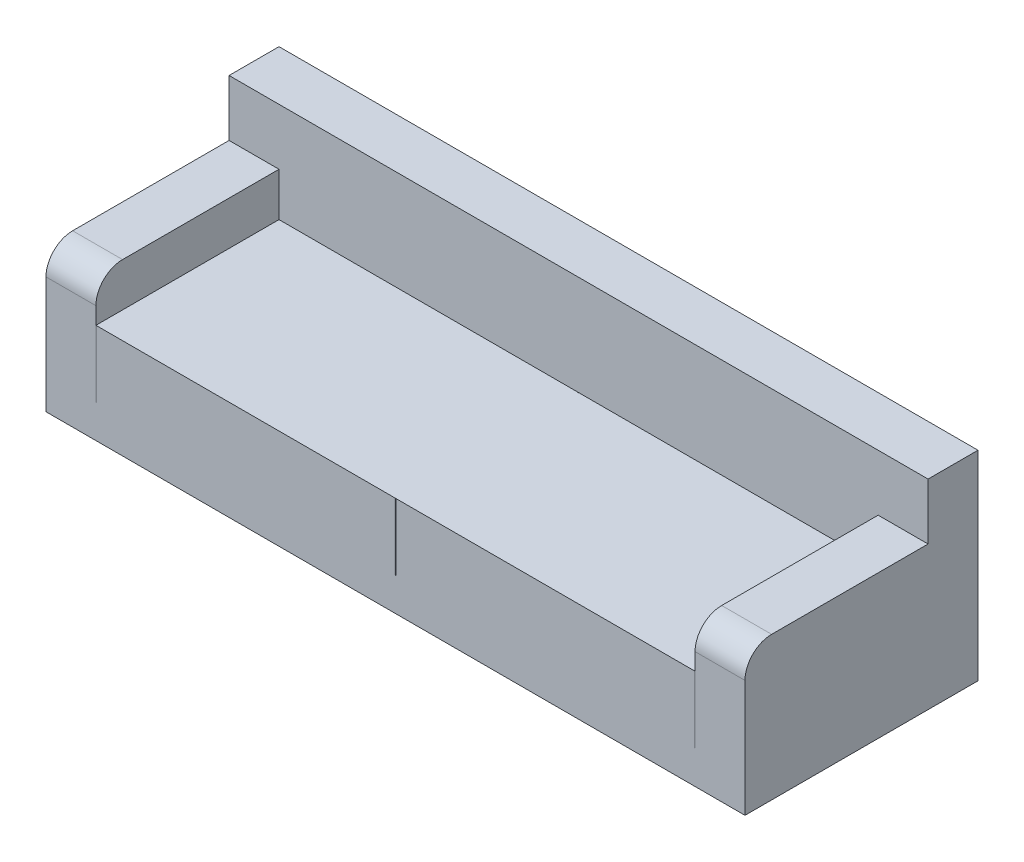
ISO-10303-21;
HEADER;
FILE_DESCRIPTION(('STEP AP214'),'2;1');
FILE_NAME('part.step','',(''),(''),'','','');
FILE_SCHEMA(('AUTOMOTIVE_DESIGN { 1 0 10303 214 1 1 1 1 }'));
ENDSEC;
DATA;
#1=APPLICATION_CONTEXT('core data for automotive mechanical design processes');
#2=APPLICATION_PROTOCOL_DEFINITION('international standard','automotive_design',2000,#1);
#3=PRODUCT_CONTEXT('',#1,'mechanical');
#4=PRODUCT('Part','Part','',(#3));
#5=PRODUCT_RELATED_PRODUCT_CATEGORY('part','',(#4));
#6=PRODUCT_DEFINITION_FORMATION('','',#4);
#7=PRODUCT_DEFINITION_CONTEXT('part definition',#1,'design');
#8=PRODUCT_DEFINITION('design','',#6,#7);
#9=PRODUCT_DEFINITION_SHAPE('','',#8);
#10=(LENGTH_UNIT() NAMED_UNIT(*) SI_UNIT(.MILLI.,.METRE.));
#11=(NAMED_UNIT(*) PLANE_ANGLE_UNIT() SI_UNIT($,.RADIAN.));
#12=(NAMED_UNIT(*) SI_UNIT($,.STERADIAN.) SOLID_ANGLE_UNIT());
#13=UNCERTAINTY_MEASURE_WITH_UNIT(LENGTH_MEASURE(1.E-05),#10,'distance_accuracy_value','');
#14=(GEOMETRIC_REPRESENTATION_CONTEXT(3) GLOBAL_UNCERTAINTY_ASSIGNED_CONTEXT((#13)) GLOBAL_UNIT_ASSIGNED_CONTEXT((#10,
#11,#12)) REPRESENTATION_CONTEXT('',''));
#15=CARTESIAN_POINT('',(0.,0.,0.));
#16=DIRECTION('',(0.,0.,1.));
#17=DIRECTION('',(1.,0.,0.));
#18=AXIS2_PLACEMENT_3D('',#15,#16,#17);
#19=CARTESIAN_POINT('',(0.,0.,0.));
#20=DIRECTION('',(0.,1.,0.));
#21=DIRECTION('',(0.,0.,1.));
#22=AXIS2_PLACEMENT_3D('',#19,#20,#21);
#23=PLANE('',#22);
#24=DIRECTION('',(1.,0.,0.));
#25=VECTOR('',#24,1.);
#26=CARTESIAN_POINT('',(1500.,0.,-275.));
#27=LINE('',#26,#25);
#28=CARTESIAN_POINT('',(-450.,0.,-275.));
#29=VERTEX_POINT('',#28);
#30=CARTESIAN_POINT('',(-449.,0.,-275.));
#31=VERTEX_POINT('',#30);
#32=EDGE_CURVE('E289',#29,#31,#27,.T.);
#33=ORIENTED_EDGE('',*,*,#32,.F.);
#34=DIRECTION('',(0.,0.,-1.));
#35=VECTOR('',#34,1.);
#36=CARTESIAN_POINT('',(-450.,0.,-275.));
#37=LINE('',#36,#35);
#38=CARTESIAN_POINT('',(-450.,0.,-274.));
#39=VERTEX_POINT('',#38);
#40=EDGE_CURVE('E232',#39,#29,#37,.T.);
#41=ORIENTED_EDGE('',*,*,#40,.F.);
#42=CARTESIAN_POINT('',(-449.,0.,-274.));
#43=DIRECTION('',(0.,1.,0.));
#44=DIRECTION('',(0.,0.,1.));
#45=AXIS2_PLACEMENT_3D('',#42,#43,#44);
#46=CIRCLE('',#45,1.);
#47=EDGE_CURVE('E417',#39,#31,#46,.F.);
#48=ORIENTED_EDGE('',*,*,#47,.T.);
#49=EDGE_LOOP('',(#33,#41,#48));
#50=FACE_BOUND('',#49,.T.);
#51=ADVANCED_FACE('F32',(#50),#23,.T.);
#52=CARTESIAN_POINT('',(-449.,0.,274.));
#53=DIRECTION('',(0.,1.,0.));
#54=DIRECTION('',(0.,0.,1.));
#55=AXIS2_PLACEMENT_3D('',#52,#53,#54);
#56=CIRCLE('',#55,1.);
#57=CARTESIAN_POINT('',(-449.,0.,275.));
#58=VERTEX_POINT('',#57);
#59=CARTESIAN_POINT('',(-450.,0.,274.));
#60=VERTEX_POINT('',#59);
#61=EDGE_CURVE('E421',#58,#60,#56,.F.);
#62=ORIENTED_EDGE('',*,*,#61,.T.);
#63=CARTESIAN_POINT('',(-450.,0.,275.));
#64=VERTEX_POINT('',#63);
#65=EDGE_CURVE('E235',#64,#60,#37,.T.);
#66=ORIENTED_EDGE('',*,*,#65,.F.);
#67=DIRECTION('',(-1.,0.,0.));
#68=VECTOR('',#67,1.);
#69=CARTESIAN_POINT('',(1500.,0.,275.));
#70=LINE('',#69,#68);
#71=EDGE_CURVE('E290',#58,#64,#70,.T.);
#72=ORIENTED_EDGE('',*,*,#71,.F.);
#73=EDGE_LOOP('',(#62,#66,#72));
#74=FACE_BOUND('',#73,.T.);
#75=ADVANCED_FACE('F442',(#74),#23,.T.);
#76=CARTESIAN_POINT('',(1350.,0.,275.));
#77=VERTEX_POINT('',#76);
#78=CARTESIAN_POINT('',(1349.,0.,275.));
#79=VERTEX_POINT('',#78);
#80=EDGE_CURVE('E272',#77,#79,#70,.T.);
#81=ORIENTED_EDGE('',*,*,#80,.F.);
#82=DIRECTION('',(0.,0.,-1.));
#83=VECTOR('',#82,1.);
#84=CARTESIAN_POINT('',(1350.,0.,0.));
#85=LINE('',#84,#83);
#86=CARTESIAN_POINT('',(1350.,0.,274.));
#87=VERTEX_POINT('',#86);
#88=EDGE_CURVE('E374',#77,#87,#85,.T.);
#89=ORIENTED_EDGE('',*,*,#88,.T.);
#90=CARTESIAN_POINT('',(1349.,0.,274.));
#91=DIRECTION('',(0.,1.,0.));
#92=DIRECTION('',(0.,0.,1.));
#93=AXIS2_PLACEMENT_3D('',#90,#91,#92);
#94=CIRCLE('',#93,1.);
#95=EDGE_CURVE('E386',#87,#79,#94,.F.);
#96=ORIENTED_EDGE('',*,*,#95,.T.);
#97=EDGE_LOOP('',(#81,#89,#96));
#98=FACE_BOUND('',#97,.T.);
#99=ADVANCED_FACE('F549',(#98),#23,.T.);
#100=CARTESIAN_POINT('',(1349.,0.,-274.));
#101=DIRECTION('',(0.,1.,0.));
#102=DIRECTION('',(0.,0.,1.));
#103=AXIS2_PLACEMENT_3D('',#100,#101,#102);
#104=CIRCLE('',#103,1.);
#105=CARTESIAN_POINT('',(1349.,0.,-275.));
#106=VERTEX_POINT('',#105);
#107=CARTESIAN_POINT('',(1350.,0.,-274.));
#108=VERTEX_POINT('',#107);
#109=EDGE_CURVE('E471',#106,#108,#104,.F.);
#110=ORIENTED_EDGE('',*,*,#109,.T.);
#111=DIRECTION('',(0.,0.,1.));
#112=VECTOR('',#111,1.);
#113=CARTESIAN_POINT('',(1350.,0.,-275.));
#114=LINE('',#113,#112);
#115=CARTESIAN_POINT('',(1350.,0.,-275.));
#116=VERTEX_POINT('',#115);
#117=EDGE_CURVE('E252',#116,#108,#114,.T.);
#118=ORIENTED_EDGE('',*,*,#117,.F.);
#119=EDGE_CURVE('E268',#106,#116,#27,.T.);
#120=ORIENTED_EDGE('',*,*,#119,.F.);
#121=EDGE_LOOP('',(#110,#118,#120));
#122=FACE_BOUND('',#121,.T.);
#123=ADVANCED_FACE('F551',(#122),#23,.T.);
#124=CARTESIAN_POINT('',(-450.,200.,275.));
#125=DIRECTION('',(0.,0.,-1.));
#126=DIRECTION('',(-1.,0.,0.));
#127=AXIS2_PLACEMENT_3D('',#124,#125,#126);
#128=PLANE('',#127);
#129=DIRECTION('',(0.,1.,0.));
#130=VECTOR('',#129,1.);
#131=CARTESIAN_POINT('',(1500.,-100.,275.));
#132=LINE('',#131,#130);
#133=CARTESIAN_POINT('',(1500.,-100.,275.));
#134=VERTEX_POINT('',#133);
#135=CARTESIAN_POINT('',(1500.,251.,275.));
#136=VERTEX_POINT('',#135);
#137=EDGE_CURVE('E296',#134,#136,#132,.T.);
#138=ORIENTED_EDGE('',*,*,#137,.T.);
#139=DIRECTION('',(1.,0.,0.));
#140=VECTOR('',#139,1.);
#141=CARTESIAN_POINT('',(-450.,251.,275.));
#142=LINE('',#141,#140);
#143=CARTESIAN_POINT('',(1350.,251.,275.));
#144=VERTEX_POINT('',#143);
#145=EDGE_CURVE('E332',#136,#144,#142,.F.);
#146=ORIENTED_EDGE('',*,*,#145,.T.);
#147=DIRECTION('',(0.,-1.,0.));
#148=VECTOR('',#147,1.);
#149=CARTESIAN_POINT('',(1350.,331.,275.));
#150=LINE('',#149,#148);
#151=EDGE_CURVE('E262',#144,#77,#150,.T.);
#152=ORIENTED_EDGE('',*,*,#151,.T.);
#153=ORIENTED_EDGE('',*,*,#80,.T.);
#154=DIRECTION('',(0.,-1.,0.));
#155=VECTOR('',#154,1.);
#156=CARTESIAN_POINT('',(1349.,200.,275.));
#157=LINE('',#156,#155);
#158=CARTESIAN_POINT('',(1349.,200.,275.));
#159=VERTEX_POINT('',#158);
#160=EDGE_CURVE('E387',#79,#159,#157,.F.);
#161=ORIENTED_EDGE('',*,*,#160,.T.);
#162=DIRECTION('',(1.,0.,0.));
#163=VECTOR('',#162,1.);
#164=CARTESIAN_POINT('',(450.,200.,275.));
#165=LINE('',#164,#163);
#166=CARTESIAN_POINT('',(451.,200.,275.));
#167=VERTEX_POINT('',#166);
#168=EDGE_CURVE('E518',#167,#159,#165,.T.);
#169=ORIENTED_EDGE('',*,*,#168,.F.);
#170=DIRECTION('',(0.,-1.,0.));
#171=VECTOR('',#170,1.);
#172=CARTESIAN_POINT('',(451.,200.,275.));
#173=LINE('',#172,#171);
#174=CARTESIAN_POINT('',(451.,0.,275.));
#175=VERTEX_POINT('',#174);
#176=EDGE_CURVE('E383',#167,#175,#173,.T.);
#177=ORIENTED_EDGE('',*,*,#176,.T.);
#178=CARTESIAN_POINT('',(449.,0.,275.));
#179=VERTEX_POINT('',#178);
#180=EDGE_CURVE('E293',#175,#179,#70,.T.);
#181=ORIENTED_EDGE('',*,*,#180,.T.);
#182=DIRECTION('',(0.,-1.,0.));
#183=VECTOR('',#182,1.);
#184=CARTESIAN_POINT('',(449.,200.,275.));
#185=LINE('',#184,#183);
#186=CARTESIAN_POINT('',(449.,200.,275.));
#187=VERTEX_POINT('',#186);
#188=EDGE_CURVE('E397',#179,#187,#185,.F.);
#189=ORIENTED_EDGE('',*,*,#188,.T.);
#190=DIRECTION('',(1.,0.,0.));
#191=VECTOR('',#190,1.);
#192=CARTESIAN_POINT('',(-450.,200.,275.));
#193=LINE('',#192,#191);
#194=CARTESIAN_POINT('',(-449.,200.,275.));
#195=VERTEX_POINT('',#194);
#196=EDGE_CURVE('E400',#195,#187,#193,.T.);
#197=ORIENTED_EDGE('',*,*,#196,.F.);
#198=DIRECTION('',(0.,-1.,0.));
#199=VECTOR('',#198,1.);
#200=CARTESIAN_POINT('',(-449.,200.,275.));
#201=LINE('',#200,#199);
#202=EDGE_CURVE('E399',#195,#58,#201,.T.);
#203=ORIENTED_EDGE('',*,*,#202,.T.);
#204=ORIENTED_EDGE('',*,*,#71,.T.);
#205=DIRECTION('',(0.,-1.,0.));
#206=VECTOR('',#205,1.);
#207=CARTESIAN_POINT('',(-450.,331.,275.));
#208=LINE('',#207,#206);
#209=CARTESIAN_POINT('',(-450.,251.,275.));
#210=VERTEX_POINT('',#209);
#211=EDGE_CURVE('E250',#210,#64,#208,.T.);
#212=ORIENTED_EDGE('',*,*,#211,.F.);
#213=DIRECTION('',(1.,0.,0.));
#214=VECTOR('',#213,1.);
#215=CARTESIAN_POINT('',(-600.,251.,275.));
#216=LINE('',#215,#214);
#217=CARTESIAN_POINT('',(-600.,251.,275.));
#218=VERTEX_POINT('',#217);
#219=EDGE_CURVE('E302',#210,#218,#216,.F.);
#220=ORIENTED_EDGE('',*,*,#219,.T.);
#221=DIRECTION('',(0.,1.,0.));
#222=VECTOR('',#221,1.);
#223=CARTESIAN_POINT('',(-600.,-100.,275.));
#224=LINE('',#223,#222);
#225=CARTESIAN_POINT('',(-600.,-100.,275.));
#226=VERTEX_POINT('',#225);
#227=EDGE_CURVE('E276',#226,#218,#224,.T.);
#228=ORIENTED_EDGE('',*,*,#227,.F.);
#229=DIRECTION('',(-1.,0.,0.));
#230=VECTOR('',#229,1.);
#231=CARTESIAN_POINT('',(1500.,-100.,275.));
#232=LINE('',#231,#230);
#233=EDGE_CURVE('E274',#134,#226,#232,.T.);
#234=ORIENTED_EDGE('',*,*,#233,.F.);
#235=EDGE_LOOP('',(#138,#146,#152,#153,#161,#169,#177,#181,#189,#197,#203,#204,#212,#220,#228,#234));
#236=FACE_BOUND('',#235,.T.);
#237=ADVANCED_FACE('F330',(#236),#128,.F.);
#238=CARTESIAN_POINT('',(0.,200.,0.));
#239=DIRECTION('',(0.,1.,0.));
#240=DIRECTION('',(0.,0.,1.));
#241=AXIS2_PLACEMENT_3D('',#238,#239,#240);
#242=PLANE('',#241);
#243=CARTESIAN_POINT('',(449.,200.,274.));
#244=DIRECTION('',(0.,1.,0.));
#245=DIRECTION('',(0.,0.,1.));
#246=AXIS2_PLACEMENT_3D('',#243,#244,#245);
#247=CIRCLE('',#246,1.);
#248=CARTESIAN_POINT('',(450.,200.,274.));
#249=VERTEX_POINT('',#248);
#250=EDGE_CURVE('E448',#187,#249,#247,.T.);
#251=ORIENTED_EDGE('',*,*,#250,.T.);
#252=CARTESIAN_POINT('',(451.,200.,274.));
#253=DIRECTION('',(0.,1.,0.));
#254=DIRECTION('',(0.,0.,1.));
#255=AXIS2_PLACEMENT_3D('',#252,#253,#254);
#256=CIRCLE('',#255,1.);
#257=EDGE_CURVE('E481',#249,#167,#256,.T.);
#258=ORIENTED_EDGE('',*,*,#257,.T.);
#259=ORIENTED_EDGE('',*,*,#168,.T.);
#260=CARTESIAN_POINT('',(1349.,200.,274.));
#261=DIRECTION('',(0.,1.,0.));
#262=DIRECTION('',(0.,0.,1.));
#263=AXIS2_PLACEMENT_3D('',#260,#261,#262);
#264=CIRCLE('',#263,1.);
#265=CARTESIAN_POINT('',(1350.,200.,274.));
#266=VERTEX_POINT('',#265);
#267=EDGE_CURVE('E393',#159,#266,#264,.T.);
#268=ORIENTED_EDGE('',*,*,#267,.T.);
#269=DIRECTION('',(0.,0.,-1.));
#270=VECTOR('',#269,1.);
#271=CARTESIAN_POINT('',(1350.,200.,-275.));
#272=LINE('',#271,#270);
#273=CARTESIAN_POINT('',(1350.,200.,-274.));
#274=VERTEX_POINT('',#273);
#275=EDGE_CURVE('E298',#266,#274,#272,.T.);
#276=ORIENTED_EDGE('',*,*,#275,.T.);
#277=CARTESIAN_POINT('',(1349.,200.,-274.));
#278=DIRECTION('',(0.,1.,0.));
#279=DIRECTION('',(0.,0.,1.));
#280=AXIS2_PLACEMENT_3D('',#277,#278,#279);
#281=CIRCLE('',#280,1.);
#282=CARTESIAN_POINT('',(1349.,200.,-275.));
#283=VERTEX_POINT('',#282);
#284=EDGE_CURVE('E516',#274,#283,#281,.T.);
#285=ORIENTED_EDGE('',*,*,#284,.T.);
#286=DIRECTION('',(-1.,0.,0.));
#287=VECTOR('',#286,1.);
#288=CARTESIAN_POINT('',(450.,200.,-275.));
#289=LINE('',#288,#287);
#290=CARTESIAN_POINT('',(451.,200.,-275.));
#291=VERTEX_POINT('',#290);
#292=EDGE_CURVE('E510',#283,#291,#289,.T.);
#293=ORIENTED_EDGE('',*,*,#292,.T.);
#294=CARTESIAN_POINT('',(451.,200.,-274.));
#295=DIRECTION('',(0.,1.,0.));
#296=DIRECTION('',(0.,0.,1.));
#297=AXIS2_PLACEMENT_3D('',#294,#295,#296);
#298=CIRCLE('',#297,1.);
#299=CARTESIAN_POINT('',(450.,200.,-274.));
#300=VERTEX_POINT('',#299);
#301=EDGE_CURVE('E508',#291,#300,#298,.T.);
#302=ORIENTED_EDGE('',*,*,#301,.T.);
#303=CARTESIAN_POINT('',(449.,200.,-274.));
#304=DIRECTION('',(0.,1.,0.));
#305=DIRECTION('',(0.,0.,1.));
#306=AXIS2_PLACEMENT_3D('',#303,#304,#305);
#307=CIRCLE('',#306,1.);
#308=CARTESIAN_POINT('',(449.,200.,-275.));
#309=VERTEX_POINT('',#308);
#310=EDGE_CURVE('E449',#300,#309,#307,.T.);
#311=ORIENTED_EDGE('',*,*,#310,.T.);
#312=DIRECTION('',(-1.,0.,0.));
#313=VECTOR('',#312,1.);
#314=CARTESIAN_POINT('',(-450.,200.,-275.));
#315=LINE('',#314,#313);
#316=CARTESIAN_POINT('',(-449.,200.,-275.));
#317=VERTEX_POINT('',#316);
#318=EDGE_CURVE('E498',#309,#317,#315,.T.);
#319=ORIENTED_EDGE('',*,*,#318,.T.);
#320=CARTESIAN_POINT('',(-449.,200.,-274.));
#321=DIRECTION('',(0.,1.,0.));
#322=DIRECTION('',(0.,0.,1.));
#323=AXIS2_PLACEMENT_3D('',#320,#321,#322);
#324=CIRCLE('',#323,1.);
#325=CARTESIAN_POINT('',(-450.,200.,-274.));
#326=VERTEX_POINT('',#325);
#327=EDGE_CURVE('E454',#317,#326,#324,.T.);
#328=ORIENTED_EDGE('',*,*,#327,.T.);
#329=DIRECTION('',(0.,0.,1.));
#330=VECTOR('',#329,1.);
#331=CARTESIAN_POINT('',(-450.,200.,-275.));
#332=LINE('',#331,#330);
#333=CARTESIAN_POINT('',(-450.,200.,274.));
#334=VERTEX_POINT('',#333);
#335=EDGE_CURVE('E523',#326,#334,#332,.T.);
#336=ORIENTED_EDGE('',*,*,#335,.T.);
#337=CARTESIAN_POINT('',(-449.,200.,274.));
#338=DIRECTION('',(0.,1.,0.));
#339=DIRECTION('',(0.,0.,1.));
#340=AXIS2_PLACEMENT_3D('',#337,#338,#339);
#341=CIRCLE('',#340,1.);
#342=EDGE_CURVE('E447',#334,#195,#341,.T.);
#343=ORIENTED_EDGE('',*,*,#342,.T.);
#344=ORIENTED_EDGE('',*,*,#196,.T.);
#345=EDGE_LOOP('',(#251,#258,#259,#268,#276,#285,#293,#302,#311,#319,#328,#336,#343,#344));
#346=FACE_BOUND('',#345,.T.);
#347=ADVANCED_FACE('F513',(#346),#242,.T.);
#348=CARTESIAN_POINT('',(-449.,200.,274.));
#349=DIRECTION('',(0.,-1.,0.));
#350=DIRECTION('',(0.,0.,-1.));
#351=AXIS2_PLACEMENT_3D('',#348,#349,#350);
#352=CYLINDRICAL_SURFACE('',#351,1.);
#353=ORIENTED_EDGE('',*,*,#342,.F.);
#354=DIRECTION('',(0.,-1.,0.));
#355=VECTOR('',#354,1.);
#356=CARTESIAN_POINT('',(-450.,200.,274.));
#357=LINE('',#356,#355);
#358=EDGE_CURVE('E444',#60,#334,#357,.F.);
#359=ORIENTED_EDGE('',*,*,#358,.F.);
#360=ORIENTED_EDGE('',*,*,#61,.F.);
#361=ORIENTED_EDGE('',*,*,#202,.F.);
#362=EDGE_LOOP('',(#353,#359,#360,#361));
#363=FACE_BOUND('',#362,.T.);
#364=ADVANCED_FACE('F446',(#363),#352,.T.);
#365=CARTESIAN_POINT('',(-449.,200.,-274.));
#366=DIRECTION('',(0.,-1.,0.));
#367=DIRECTION('',(0.,0.,-1.));
#368=AXIS2_PLACEMENT_3D('',#365,#366,#367);
#369=CYLINDRICAL_SURFACE('',#368,1.);
#370=ORIENTED_EDGE('',*,*,#327,.F.);
#371=DIRECTION('',(0.,-1.,0.));
#372=VECTOR('',#371,1.);
#373=CARTESIAN_POINT('',(-449.,200.,-275.));
#374=LINE('',#373,#372);
#375=EDGE_CURVE('E424',#31,#317,#374,.F.);
#376=ORIENTED_EDGE('',*,*,#375,.F.);
#377=ORIENTED_EDGE('',*,*,#47,.F.);
#378=DIRECTION('',(0.,-1.,0.));
#379=VECTOR('',#378,1.);
#380=CARTESIAN_POINT('',(-450.,200.,-274.));
#381=LINE('',#380,#379);
#382=EDGE_CURVE('E414',#326,#39,#381,.T.);
#383=ORIENTED_EDGE('',*,*,#382,.F.);
#384=EDGE_LOOP('',(#370,#376,#377,#383));
#385=FACE_BOUND('',#384,.T.);
#386=ADVANCED_FACE('F791',(#385),#369,.T.);
#387=CARTESIAN_POINT('',(449.,200.,-274.));
#388=DIRECTION('',(0.,-1.,0.));
#389=DIRECTION('',(0.,0.,-1.));
#390=AXIS2_PLACEMENT_3D('',#387,#388,#389);
#391=CYLINDRICAL_SURFACE('',#390,1.);
#392=ORIENTED_EDGE('',*,*,#310,.F.);
#393=DIRECTION('',(0.,-1.,0.));
#394=VECTOR('',#393,1.);
#395=CARTESIAN_POINT('',(450.,200.,-274.));
#396=LINE('',#395,#394);
#397=CARTESIAN_POINT('',(450.,0.,-274.));
#398=VERTEX_POINT('',#397);
#399=EDGE_CURVE('E460',#398,#300,#396,.F.);
#400=ORIENTED_EDGE('',*,*,#399,.F.);
#401=CARTESIAN_POINT('',(449.,0.,-274.));
#402=DIRECTION('',(0.,1.,0.));
#403=DIRECTION('',(0.,0.,1.));
#404=AXIS2_PLACEMENT_3D('',#401,#402,#403);
#405=CIRCLE('',#404,1.);
#406=CARTESIAN_POINT('',(449.,0.,-275.));
#407=VERTEX_POINT('',#406);
#408=EDGE_CURVE('E405',#407,#398,#405,.F.);
#409=ORIENTED_EDGE('',*,*,#408,.F.);
#410=DIRECTION('',(0.,-1.,0.));
#411=VECTOR('',#410,1.);
#412=CARTESIAN_POINT('',(449.,200.,-275.));
#413=LINE('',#412,#411);
#414=EDGE_CURVE('E427',#309,#407,#413,.T.);
#415=ORIENTED_EDGE('',*,*,#414,.F.);
#416=EDGE_LOOP('',(#392,#400,#409,#415));
#417=FACE_BOUND('',#416,.T.);
#418=ADVANCED_FACE('F502',(#417),#391,.T.);
#419=CARTESIAN_POINT('',(449.,200.,274.));
#420=DIRECTION('',(0.,-1.,0.));
#421=DIRECTION('',(0.,0.,-1.));
#422=AXIS2_PLACEMENT_3D('',#419,#420,#421);
#423=CYLINDRICAL_SURFACE('',#422,1.);
#424=ORIENTED_EDGE('',*,*,#250,.F.);
#425=ORIENTED_EDGE('',*,*,#188,.F.);
#426=CARTESIAN_POINT('',(449.,0.,274.));
#427=DIRECTION('',(0.,1.,0.));
#428=DIRECTION('',(0.,0.,1.));
#429=AXIS2_PLACEMENT_3D('',#426,#427,#428);
#430=CIRCLE('',#429,1.);
#431=CARTESIAN_POINT('',(450.,0.,274.));
#432=VERTEX_POINT('',#431);
#433=EDGE_CURVE('E401',#432,#179,#430,.F.);
#434=ORIENTED_EDGE('',*,*,#433,.F.);
#435=DIRECTION('',(0.,-1.,0.));
#436=VECTOR('',#435,1.);
#437=CARTESIAN_POINT('',(450.,200.,274.));
#438=LINE('',#437,#436);
#439=EDGE_CURVE('E426',#249,#432,#438,.T.);
#440=ORIENTED_EDGE('',*,*,#439,.F.);
#441=EDGE_LOOP('',(#424,#425,#434,#440));
#442=FACE_BOUND('',#441,.T.);
#443=ADVANCED_FACE('F527',(#442),#423,.T.);
#444=CARTESIAN_POINT('',(451.,200.,274.));
#445=DIRECTION('',(0.,-1.,0.));
#446=DIRECTION('',(0.,0.,-1.));
#447=AXIS2_PLACEMENT_3D('',#444,#445,#446);
#448=CYLINDRICAL_SURFACE('',#447,1.);
#449=ORIENTED_EDGE('',*,*,#257,.F.);
#450=ORIENTED_EDGE('',*,*,#439,.T.);
#451=CARTESIAN_POINT('',(451.,0.,274.));
#452=DIRECTION('',(0.,1.,0.));
#453=DIRECTION('',(0.,0.,1.));
#454=AXIS2_PLACEMENT_3D('',#451,#452,#453);
#455=CIRCLE('',#454,1.);
#456=EDGE_CURVE('E390',#175,#432,#455,.F.);
#457=ORIENTED_EDGE('',*,*,#456,.F.);
#458=ORIENTED_EDGE('',*,*,#176,.F.);
#459=EDGE_LOOP('',(#449,#450,#457,#458));
#460=FACE_BOUND('',#459,.T.);
#461=ADVANCED_FACE('F531',(#460),#448,.T.);
#462=CARTESIAN_POINT('',(451.,200.,-274.));
#463=DIRECTION('',(0.,-1.,0.));
#464=DIRECTION('',(0.,0.,-1.));
#465=AXIS2_PLACEMENT_3D('',#462,#463,#464);
#466=CYLINDRICAL_SURFACE('',#465,1.);
#467=ORIENTED_EDGE('',*,*,#301,.F.);
#468=DIRECTION('',(0.,-1.,0.));
#469=VECTOR('',#468,1.);
#470=CARTESIAN_POINT('',(451.,200.,-275.));
#471=LINE('',#470,#469);
#472=CARTESIAN_POINT('',(451.,0.,-275.));
#473=VERTEX_POINT('',#472);
#474=EDGE_CURVE('E480',#473,#291,#471,.F.);
#475=ORIENTED_EDGE('',*,*,#474,.F.);
#476=CARTESIAN_POINT('',(451.,0.,-274.));
#477=DIRECTION('',(0.,1.,0.));
#478=DIRECTION('',(0.,0.,1.));
#479=AXIS2_PLACEMENT_3D('',#476,#477,#478);
#480=CIRCLE('',#479,1.);
#481=EDGE_CURVE('E394',#398,#473,#480,.F.);
#482=ORIENTED_EDGE('',*,*,#481,.F.);
#483=ORIENTED_EDGE('',*,*,#399,.T.);
#484=EDGE_LOOP('',(#467,#475,#482,#483));
#485=FACE_BOUND('',#484,.T.);
#486=ADVANCED_FACE('F507',(#485),#466,.T.);
#487=CARTESIAN_POINT('',(1349.,200.,-274.));
#488=DIRECTION('',(0.,-1.,0.));
#489=DIRECTION('',(0.,0.,-1.));
#490=AXIS2_PLACEMENT_3D('',#487,#488,#489);
#491=CYLINDRICAL_SURFACE('',#490,1.);
#492=ORIENTED_EDGE('',*,*,#284,.F.);
#493=DIRECTION('',(0.,-1.,0.));
#494=VECTOR('',#493,1.);
#495=CARTESIAN_POINT('',(1350.,200.,-274.));
#496=LINE('',#495,#494);
#497=EDGE_CURVE('E377',#108,#274,#496,.F.);
#498=ORIENTED_EDGE('',*,*,#497,.F.);
#499=ORIENTED_EDGE('',*,*,#109,.F.);
#500=DIRECTION('',(0.,-1.,0.));
#501=VECTOR('',#500,1.);
#502=CARTESIAN_POINT('',(1349.,200.,-275.));
#503=LINE('',#502,#501);
#504=EDGE_CURVE('E478',#283,#106,#503,.T.);
#505=ORIENTED_EDGE('',*,*,#504,.F.);
#506=EDGE_LOOP('',(#492,#498,#499,#505));
#507=FACE_BOUND('',#506,.T.);
#508=ADVANCED_FACE('F572',(#507),#491,.T.);
#509=CARTESIAN_POINT('',(1349.,200.,274.));
#510=DIRECTION('',(0.,-1.,0.));
#511=DIRECTION('',(0.,0.,-1.));
#512=AXIS2_PLACEMENT_3D('',#509,#510,#511);
#513=CYLINDRICAL_SURFACE('',#512,1.);
#514=ORIENTED_EDGE('',*,*,#267,.F.);
#515=ORIENTED_EDGE('',*,*,#160,.F.);
#516=ORIENTED_EDGE('',*,*,#95,.F.);
#517=DIRECTION('',(0.,-1.,0.));
#518=VECTOR('',#517,1.);
#519=CARTESIAN_POINT('',(1350.,200.,274.));
#520=LINE('',#519,#518);
#521=EDGE_CURVE('E487',#266,#87,#520,.T.);
#522=ORIENTED_EDGE('',*,*,#521,.F.);
#523=EDGE_LOOP('',(#514,#515,#516,#522));
#524=FACE_BOUND('',#523,.T.);
#525=ADVANCED_FACE('F545',(#524),#513,.T.);
#526=ORIENTED_EDGE('',*,*,#180,.F.);
#527=ORIENTED_EDGE('',*,*,#456,.T.);
#528=ORIENTED_EDGE('',*,*,#433,.T.);
#529=EDGE_LOOP('',(#526,#527,#528));
#530=FACE_BOUND('',#529,.T.);
#531=ADVANCED_FACE('F558',(#530),#23,.T.);
#532=EDGE_CURVE('E287',#407,#473,#27,.T.);
#533=ORIENTED_EDGE('',*,*,#532,.F.);
#534=ORIENTED_EDGE('',*,*,#408,.T.);
#535=ORIENTED_EDGE('',*,*,#481,.T.);
#536=EDGE_LOOP('',(#533,#534,#535));
#537=FACE_BOUND('',#536,.T.);
#538=ADVANCED_FACE('F504',(#537),#23,.T.);
#539=CARTESIAN_POINT('',(-600.,-100.,275.));
#540=DIRECTION('',(1.,0.,0.));
#541=DIRECTION('',(0.,0.,-1.));
#542=AXIS2_PLACEMENT_3D('',#539,#540,#541);
#543=PLANE('',#542);
#544=ORIENTED_EDGE('',*,*,#227,.T.);
#545=CARTESIAN_POINT('',(-600.,251.,195.));
#546=DIRECTION('',(1.,0.,0.));
#547=DIRECTION('',(0.,0.,-1.));
#548=AXIS2_PLACEMENT_3D('',#545,#546,#547);
#549=CIRCLE('',#548,80.);
#550=CARTESIAN_POINT('',(-600.,331.,195.));
#551=VERTEX_POINT('',#550);
#552=EDGE_CURVE('E55',#218,#551,#549,.F.);
#553=ORIENTED_EDGE('',*,*,#552,.T.);
#554=DIRECTION('',(0.,0.,1.));
#555=VECTOR('',#554,1.);
#556=CARTESIAN_POINT('',(-600.,331.,-275.));
#557=LINE('',#556,#555);
#558=CARTESIAN_POINT('',(-600.,331.,-275.));
#559=VERTEX_POINT('',#558);
#560=EDGE_CURVE('E240',#559,#551,#557,.T.);
#561=ORIENTED_EDGE('',*,*,#560,.F.);
#562=DIRECTION('',(0.,1.,0.));
#563=VECTOR('',#562,1.);
#564=CARTESIAN_POINT('',(-600.,-100.,-275.));
#565=LINE('',#564,#563);
#566=CARTESIAN_POINT('',(-600.,500.,-275.));
#567=VERTEX_POINT('',#566);
#568=EDGE_CURVE('E230',#559,#567,#565,.T.);
#569=ORIENTED_EDGE('',*,*,#568,.T.);
#570=DIRECTION('',(0.,0.,1.));
#571=VECTOR('',#570,1.);
#572=CARTESIAN_POINT('',(-600.,500.,-425.));
#573=LINE('',#572,#571);
#574=CARTESIAN_POINT('',(-600.,500.,-425.));
#575=VERTEX_POINT('',#574);
#576=EDGE_CURVE('E212',#575,#567,#573,.T.);
#577=ORIENTED_EDGE('',*,*,#576,.F.);
#578=DIRECTION('',(0.,1.,0.));
#579=VECTOR('',#578,1.);
#580=CARTESIAN_POINT('',(-600.,-100.,-425.));
#581=LINE('',#580,#579);
#582=CARTESIAN_POINT('',(-600.,-100.,-425.));
#583=VERTEX_POINT('',#582);
#584=EDGE_CURVE('E219',#583,#575,#581,.T.);
#585=ORIENTED_EDGE('',*,*,#584,.F.);
#586=DIRECTION('',(0.,0.,-1.));
#587=VECTOR('',#586,1.);
#588=CARTESIAN_POINT('',(-600.,-100.,275.));
#589=LINE('',#588,#587);
#590=EDGE_CURVE('E269',#226,#583,#589,.T.);
#591=ORIENTED_EDGE('',*,*,#590,.F.);
#592=EDGE_LOOP('',(#544,#553,#561,#569,#577,#585,#591));
#593=FACE_BOUND('',#592,.T.);
#594=ADVANCED_FACE('F229',(#593),#543,.F.);
#595=CARTESIAN_POINT('',(1500.,-100.,275.));
#596=DIRECTION('',(-1.,0.,0.));
#597=DIRECTION('',(0.,0.,1.));
#598=AXIS2_PLACEMENT_3D('',#595,#596,#597);
#599=PLANE('',#598);
#600=DIRECTION('',(0.,0.,-1.));
#601=VECTOR('',#600,1.);
#602=CARTESIAN_POINT('',(1500.,331.,-275.));
#603=LINE('',#602,#601);
#604=CARTESIAN_POINT('',(1500.,331.,195.));
#605=VERTEX_POINT('',#604);
#606=CARTESIAN_POINT('',(1500.,331.,-275.));
#607=VERTEX_POINT('',#606);
#608=EDGE_CURVE('E253',#605,#607,#603,.T.);
#609=ORIENTED_EDGE('',*,*,#608,.F.);
#610=CARTESIAN_POINT('',(1500.,251.,195.));
#611=DIRECTION('',(-1.,0.,0.));
#612=DIRECTION('',(0.,0.,1.));
#613=AXIS2_PLACEMENT_3D('',#610,#611,#612);
#614=CIRCLE('',#613,80.);
#615=EDGE_CURVE('E339',#605,#136,#614,.F.);
#616=ORIENTED_EDGE('',*,*,#615,.T.);
#617=ORIENTED_EDGE('',*,*,#137,.F.);
#618=DIRECTION('',(0.,0.,1.));
#619=VECTOR('',#618,1.);
#620=CARTESIAN_POINT('',(1500.,-100.,275.));
#621=LINE('',#620,#619);
#622=CARTESIAN_POINT('',(1500.,-100.,-425.));
#623=VERTEX_POINT('',#622);
#624=EDGE_CURVE('E271',#623,#134,#621,.T.);
#625=ORIENTED_EDGE('',*,*,#624,.F.);
#626=DIRECTION('',(0.,-1.,0.));
#627=VECTOR('',#626,1.);
#628=CARTESIAN_POINT('',(1500.,-100.,-425.));
#629=LINE('',#628,#627);
#630=CARTESIAN_POINT('',(1500.,500.,-425.));
#631=VERTEX_POINT('',#630);
#632=EDGE_CURVE('E218',#631,#623,#629,.T.);
#633=ORIENTED_EDGE('',*,*,#632,.F.);
#634=DIRECTION('',(0.,0.,1.));
#635=VECTOR('',#634,1.);
#636=CARTESIAN_POINT('',(1500.,500.,-425.));
#637=LINE('',#636,#635);
#638=CARTESIAN_POINT('',(1500.,500.,-275.));
#639=VERTEX_POINT('',#638);
#640=EDGE_CURVE('E214',#631,#639,#637,.T.);
#641=ORIENTED_EDGE('',*,*,#640,.T.);
#642=DIRECTION('',(0.,-1.,0.));
#643=VECTOR('',#642,1.);
#644=CARTESIAN_POINT('',(1500.,-100.,-275.));
#645=LINE('',#644,#643);
#646=EDGE_CURVE('E227',#639,#607,#645,.T.);
#647=ORIENTED_EDGE('',*,*,#646,.T.);
#648=EDGE_LOOP('',(#609,#616,#617,#625,#633,#641,#647));
#649=FACE_BOUND('',#648,.T.);
#650=ADVANCED_FACE('F322',(#649),#599,.F.);
#651=CARTESIAN_POINT('',(0.,-100.,0.));
#652=DIRECTION('',(0.,1.,0.));
#653=DIRECTION('',(0.,0.,1.));
#654=AXIS2_PLACEMENT_3D('',#651,#652,#653);
#655=PLANE('',#654);
#656=CARTESIAN_POINT('',(-500.,-100.,-325.));
#657=DIRECTION('',(0.,1.,0.));
#658=DIRECTION('',(0.,0.,1.));
#659=AXIS2_PLACEMENT_3D('',#656,#657,#658);
#660=CIRCLE('',#659,50.0000000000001);
#661=CARTESIAN_POINT('',(-500.,-100.,-275.));
#662=VERTEX_POINT('',#661);
#663=EDGE_CURVE('E11',#662,#662,#660,.F.);
#664=ORIENTED_EDGE('',*,*,#663,.F.);
#665=EDGE_LOOP('',(#664));
#666=FACE_BOUND('',#665,.T.);
#667=CARTESIAN_POINT('',(1400.,-100.,-325.));
#668=DIRECTION('',(0.,1.,0.));
#669=DIRECTION('',(0.,0.,1.));
#670=AXIS2_PLACEMENT_3D('',#667,#668,#669);
#671=CIRCLE('',#670,50.);
#672=CARTESIAN_POINT('',(1400.,-100.,-275.));
#673=VERTEX_POINT('',#672);
#674=EDGE_CURVE('E40',#673,#673,#671,.F.);
#675=ORIENTED_EDGE('',*,*,#674,.F.);
#676=EDGE_LOOP('',(#675));
#677=FACE_BOUND('',#676,.T.);
#678=CARTESIAN_POINT('',(1400.,-100.,175.));
#679=DIRECTION('',(0.,1.,0.));
#680=DIRECTION('',(0.,0.,1.));
#681=AXIS2_PLACEMENT_3D('',#678,#679,#680);
#682=CIRCLE('',#681,50.);
#683=CARTESIAN_POINT('',(1400.,-100.,225.));
#684=VERTEX_POINT('',#683);
#685=EDGE_CURVE('E307',#684,#684,#682,.F.);
#686=ORIENTED_EDGE('',*,*,#685,.F.);
#687=EDGE_LOOP('',(#686));
#688=FACE_BOUND('',#687,.T.);
#689=CARTESIAN_POINT('',(-500.,-100.,175.));
#690=DIRECTION('',(0.,1.,0.));
#691=DIRECTION('',(0.,0.,1.));
#692=AXIS2_PLACEMENT_3D('',#689,#690,#691);
#693=CIRCLE('',#692,50.0000000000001);
#694=CARTESIAN_POINT('',(-500.,-100.,225.));
#695=VERTEX_POINT('',#694);
#696=EDGE_CURVE('E304',#695,#695,#693,.F.);
#697=ORIENTED_EDGE('',*,*,#696,.F.);
#698=EDGE_LOOP('',(#697));
#699=FACE_BOUND('',#698,.T.);
#700=ORIENTED_EDGE('',*,*,#590,.T.);
#701=DIRECTION('',(-1.,0.,0.));
#702=VECTOR('',#701,1.);
#703=CARTESIAN_POINT('',(-600.,-100.,-425.));
#704=LINE('',#703,#702);
#705=EDGE_CURVE('E225',#623,#583,#704,.T.);
#706=ORIENTED_EDGE('',*,*,#705,.F.);
#707=ORIENTED_EDGE('',*,*,#624,.T.);
#708=ORIENTED_EDGE('',*,*,#233,.T.);
#709=EDGE_LOOP('',(#700,#706,#707,#708));
#710=FACE_BOUND('',#709,.T.);
#711=ADVANCED_FACE('F318',(#666,#677,#688,#699,#710),#655,.F.);
#712=CARTESIAN_POINT('',(1350.,331.,-275.));
#713=DIRECTION('',(1.,0.,0.));
#714=DIRECTION('',(0.,0.,-1.));
#715=AXIS2_PLACEMENT_3D('',#712,#713,#714);
#716=PLANE('',#715);
#717=ORIENTED_EDGE('',*,*,#151,.F.);
#718=CARTESIAN_POINT('',(1350.,251.,195.));
#719=DIRECTION('',(1.,0.,0.));
#720=DIRECTION('',(0.,0.,-1.));
#721=AXIS2_PLACEMENT_3D('',#718,#719,#720);
#722=CIRCLE('',#721,80.);
#723=CARTESIAN_POINT('',(1350.,331.,195.));
#724=VERTEX_POINT('',#723);
#725=EDGE_CURVE('E341',#144,#724,#722,.F.);
#726=ORIENTED_EDGE('',*,*,#725,.T.);
#727=DIRECTION('',(0.,0.,1.));
#728=VECTOR('',#727,1.);
#729=CARTESIAN_POINT('',(1350.,331.,-275.));
#730=LINE('',#729,#728);
#731=CARTESIAN_POINT('',(1350.,331.,-275.));
#732=VERTEX_POINT('',#731);
#733=EDGE_CURVE('E259',#732,#724,#730,.T.);
#734=ORIENTED_EDGE('',*,*,#733,.F.);
#735=DIRECTION('',(0.,-1.,0.));
#736=VECTOR('',#735,1.);
#737=CARTESIAN_POINT('',(1350.,331.,-275.));
#738=LINE('',#737,#736);
#739=EDGE_CURVE('E265',#732,#116,#738,.T.);
#740=ORIENTED_EDGE('',*,*,#739,.T.);
#741=ORIENTED_EDGE('',*,*,#117,.T.);
#742=ORIENTED_EDGE('',*,*,#497,.T.);
#743=ORIENTED_EDGE('',*,*,#275,.F.);
#744=ORIENTED_EDGE('',*,*,#521,.T.);
#745=ORIENTED_EDGE('',*,*,#88,.F.);
#746=EDGE_LOOP('',(#717,#726,#734,#740,#741,#742,#743,#744,#745));
#747=FACE_BOUND('',#746,.T.);
#748=ADVANCED_FACE('F321',(#747),#716,.F.);
#749=CARTESIAN_POINT('',(0.,331.,0.));
#750=DIRECTION('',(0.,-1.,0.));
#751=DIRECTION('',(0.,0.,-1.));
#752=AXIS2_PLACEMENT_3D('',#749,#750,#751);
#753=PLANE('',#752);
#754=ORIENTED_EDGE('',*,*,#733,.T.);
#755=DIRECTION('',(1.,0.,0.));
#756=VECTOR('',#755,1.);
#757=CARTESIAN_POINT('',(0.,331.,195.));
#758=LINE('',#757,#756);
#759=EDGE_CURVE('E373',#724,#605,#758,.T.);
#760=ORIENTED_EDGE('',*,*,#759,.T.);
#761=ORIENTED_EDGE('',*,*,#608,.T.);
#762=DIRECTION('',(-1.,0.,0.));
#763=VECTOR('',#762,1.);
#764=CARTESIAN_POINT('',(1500.,331.,-275.));
#765=LINE('',#764,#763);
#766=EDGE_CURVE('E256',#607,#732,#765,.T.);
#767=ORIENTED_EDGE('',*,*,#766,.T.);
#768=EDGE_LOOP('',(#754,#760,#761,#767));
#769=FACE_BOUND('',#768,.T.);
#770=ADVANCED_FACE('F371',(#769),#753,.F.);
#771=CARTESIAN_POINT('',(-450.,331.,-275.));
#772=DIRECTION('',(-1.,0.,0.));
#773=DIRECTION('',(0.,0.,1.));
#774=AXIS2_PLACEMENT_3D('',#771,#772,#773);
#775=PLANE('',#774);
#776=DIRECTION('',(0.,0.,-1.));
#777=VECTOR('',#776,1.);
#778=CARTESIAN_POINT('',(-450.,331.,-275.));
#779=LINE('',#778,#777);
#780=CARTESIAN_POINT('',(-450.,331.,195.));
#781=VERTEX_POINT('',#780);
#782=CARTESIAN_POINT('',(-450.,331.,-275.));
#783=VERTEX_POINT('',#782);
#784=EDGE_CURVE('E242',#781,#783,#779,.T.);
#785=ORIENTED_EDGE('',*,*,#784,.F.);
#786=CARTESIAN_POINT('',(-450.,251.,195.));
#787=DIRECTION('',(-1.,0.,0.));
#788=DIRECTION('',(0.,0.,1.));
#789=AXIS2_PLACEMENT_3D('',#786,#787,#788);
#790=CIRCLE('',#789,80.);
#791=EDGE_CURVE('E47',#781,#210,#790,.F.);
#792=ORIENTED_EDGE('',*,*,#791,.T.);
#793=ORIENTED_EDGE('',*,*,#211,.T.);
#794=ORIENTED_EDGE('',*,*,#65,.T.);
#795=ORIENTED_EDGE('',*,*,#358,.T.);
#796=ORIENTED_EDGE('',*,*,#335,.F.);
#797=ORIENTED_EDGE('',*,*,#382,.T.);
#798=ORIENTED_EDGE('',*,*,#40,.T.);
#799=DIRECTION('',(0.,-1.,0.));
#800=VECTOR('',#799,1.);
#801=CARTESIAN_POINT('',(-450.,331.,-275.));
#802=LINE('',#801,#800);
#803=EDGE_CURVE('E247',#783,#29,#802,.T.);
#804=ORIENTED_EDGE('',*,*,#803,.F.);
#805=EDGE_LOOP('',(#785,#792,#793,#794,#795,#796,#797,#798,#804));
#806=FACE_BOUND('',#805,.T.);
#807=ADVANCED_FACE('F351',(#806),#775,.F.);
#808=CARTESIAN_POINT('',(0.,331.,0.));
#809=DIRECTION('',(0.,1.,0.));
#810=DIRECTION('',(0.,0.,1.));
#811=AXIS2_PLACEMENT_3D('',#808,#809,#810);
#812=PLANE('',#811);
#813=ORIENTED_EDGE('',*,*,#560,.T.);
#814=DIRECTION('',(1.,0.,0.));
#815=VECTOR('',#814,1.);
#816=CARTESIAN_POINT('',(-450.,331.,195.));
#817=LINE('',#816,#815);
#818=EDGE_CURVE('E303',#551,#781,#817,.T.);
#819=ORIENTED_EDGE('',*,*,#818,.T.);
#820=ORIENTED_EDGE('',*,*,#784,.T.);
#821=DIRECTION('',(-1.,0.,0.));
#822=VECTOR('',#821,1.);
#823=CARTESIAN_POINT('',(-600.,331.,-275.));
#824=LINE('',#823,#822);
#825=EDGE_CURVE('E245',#783,#559,#824,.T.);
#826=ORIENTED_EDGE('',*,*,#825,.T.);
#827=EDGE_LOOP('',(#813,#819,#820,#826));
#828=FACE_BOUND('',#827,.T.);
#829=ADVANCED_FACE('F348',(#828),#812,.T.);
#830=CARTESIAN_POINT('',(0.,251.,195.));
#831=DIRECTION('',(1.,0.,0.));
#832=DIRECTION('',(0.,0.,-1.));
#833=AXIS2_PLACEMENT_3D('',#830,#831,#832);
#834=CYLINDRICAL_SURFACE('',#833,80.);
#835=ORIENTED_EDGE('',*,*,#725,.F.);
#836=ORIENTED_EDGE('',*,*,#145,.F.);
#837=ORIENTED_EDGE('',*,*,#615,.F.);
#838=ORIENTED_EDGE('',*,*,#759,.F.);
#839=EDGE_LOOP('',(#835,#836,#837,#838));
#840=FACE_BOUND('',#839,.T.);
#841=ADVANCED_FACE('F337',(#840),#834,.T.);
#842=CARTESIAN_POINT('',(0.,251.,195.));
#843=DIRECTION('',(-1.,0.,0.));
#844=DIRECTION('',(0.,0.,1.));
#845=AXIS2_PLACEMENT_3D('',#842,#843,#844);
#846=CYLINDRICAL_SURFACE('',#845,80.);
#847=ORIENTED_EDGE('',*,*,#552,.F.);
#848=ORIENTED_EDGE('',*,*,#219,.F.);
#849=ORIENTED_EDGE('',*,*,#791,.F.);
#850=ORIENTED_EDGE('',*,*,#818,.F.);
#851=EDGE_LOOP('',(#847,#848,#849,#850));
#852=FACE_BOUND('',#851,.T.);
#853=ADVANCED_FACE('F34',(#852),#846,.T.);
#854=CARTESIAN_POINT('',(0.,0.,-275.));
#855=DIRECTION('',(0.,0.,-1.));
#856=DIRECTION('',(-1.,0.,0.));
#857=AXIS2_PLACEMENT_3D('',#854,#855,#856);
#858=PLANE('',#857);
#859=ORIENTED_EDGE('',*,*,#739,.F.);
#860=ORIENTED_EDGE('',*,*,#766,.F.);
#861=ORIENTED_EDGE('',*,*,#646,.F.);
#862=DIRECTION('',(1.,0.,0.));
#863=VECTOR('',#862,1.);
#864=CARTESIAN_POINT('',(-600.,500.,-275.));
#865=LINE('',#864,#863);
#866=EDGE_CURVE('E359',#567,#639,#865,.T.);
#867=ORIENTED_EDGE('',*,*,#866,.F.);
#868=ORIENTED_EDGE('',*,*,#568,.F.);
#869=ORIENTED_EDGE('',*,*,#825,.F.);
#870=ORIENTED_EDGE('',*,*,#803,.T.);
#871=ORIENTED_EDGE('',*,*,#32,.T.);
#872=ORIENTED_EDGE('',*,*,#375,.T.);
#873=ORIENTED_EDGE('',*,*,#318,.F.);
#874=ORIENTED_EDGE('',*,*,#414,.T.);
#875=ORIENTED_EDGE('',*,*,#532,.T.);
#876=ORIENTED_EDGE('',*,*,#474,.T.);
#877=ORIENTED_EDGE('',*,*,#292,.F.);
#878=ORIENTED_EDGE('',*,*,#504,.T.);
#879=ORIENTED_EDGE('',*,*,#119,.T.);
#880=EDGE_LOOP('',(#859,#860,#861,#867,#868,#869,#870,#871,#872,#873,#874,#875,#876,#877,#878,#879));
#881=FACE_BOUND('',#880,.T.);
#882=ADVANCED_FACE('F356',(#881),#858,.F.);
#883=CARTESIAN_POINT('',(-600.,500.,-425.));
#884=DIRECTION('',(0.,-1.,0.));
#885=DIRECTION('',(1.,0.,0.));
#886=AXIS2_PLACEMENT_3D('',#883,#884,#885);
#887=PLANE('',#886);
#888=ORIENTED_EDGE('',*,*,#866,.T.);
#889=ORIENTED_EDGE('',*,*,#640,.F.);
#890=DIRECTION('',(1.,0.,0.));
#891=VECTOR('',#890,1.);
#892=CARTESIAN_POINT('',(-600.,500.,-425.));
#893=LINE('',#892,#891);
#894=EDGE_CURVE('E208',#575,#631,#893,.T.);
#895=ORIENTED_EDGE('',*,*,#894,.F.);
#896=ORIENTED_EDGE('',*,*,#576,.T.);
#897=EDGE_LOOP('',(#888,#889,#895,#896));
#898=FACE_BOUND('',#897,.T.);
#899=ADVANCED_FACE('F210',(#898),#887,.F.);
#900=CARTESIAN_POINT('',(0.,0.,-425.));
#901=DIRECTION('',(0.,0.,-1.));
#902=DIRECTION('',(-1.,0.,0.));
#903=AXIS2_PLACEMENT_3D('',#900,#901,#902);
#904=PLANE('',#903);
#905=ORIENTED_EDGE('',*,*,#584,.T.);
#906=ORIENTED_EDGE('',*,*,#894,.T.);
#907=ORIENTED_EDGE('',*,*,#632,.T.);
#908=ORIENTED_EDGE('',*,*,#705,.T.);
#909=EDGE_LOOP('',(#905,#906,#907,#908));
#910=FACE_BOUND('',#909,.T.);
#911=ADVANCED_FACE('F223',(#910),#904,.T.);
#912=CARTESIAN_POINT('',(-500.,-150.,175.));
#913=DIRECTION('',(0.,1.,0.));
#914=DIRECTION('',(0.,0.,1.));
#915=AXIS2_PLACEMENT_3D('',#912,#913,#914);
#916=CYLINDRICAL_SURFACE('',#915,50.0000000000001);
#917=CARTESIAN_POINT('',(-500.,-150.,175.));
#918=DIRECTION('',(0.,-1.,0.));
#919=DIRECTION('',(0.,0.,-1.));
#920=AXIS2_PLACEMENT_3D('',#917,#918,#919);
#921=CIRCLE('',#920,50.0000000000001);
#922=CARTESIAN_POINT('',(-500.,-150.,125.));
#923=VERTEX_POINT('',#922);
#924=EDGE_CURVE('E360',#923,#923,#921,.T.);
#925=ORIENTED_EDGE('',*,*,#924,.F.);
#926=EDGE_LOOP('',(#925));
#927=FACE_BOUND('',#926,.T.);
#928=ORIENTED_EDGE('',*,*,#696,.T.);
#929=EDGE_LOOP('',(#928));
#930=FACE_BOUND('',#929,.T.);
#931=ADVANCED_FACE('F639',(#927,#930),#916,.T.);
#932=CARTESIAN_POINT('',(-500.,-150.,175.));
#933=DIRECTION('',(0.,-1.,0.));
#934=DIRECTION('',(0.,0.,-1.));
#935=AXIS2_PLACEMENT_3D('',#932,#933,#934);
#936=PLANE('',#935);
#937=ORIENTED_EDGE('',*,*,#924,.T.);
#938=EDGE_LOOP('',(#937));
#939=FACE_BOUND('',#938,.T.);
#940=ADVANCED_FACE('F654',(#939),#936,.T.);
#941=CARTESIAN_POINT('',(1400.,-150.,175.));
#942=DIRECTION('',(0.,1.,0.));
#943=DIRECTION('',(0.,0.,1.));
#944=AXIS2_PLACEMENT_3D('',#941,#942,#943);
#945=CYLINDRICAL_SURFACE('',#944,50.);
#946=CARTESIAN_POINT('',(1400.,-150.,175.));
#947=DIRECTION('',(0.,-1.,0.));
#948=DIRECTION('',(0.,0.,-1.));
#949=AXIS2_PLACEMENT_3D('',#946,#947,#948);
#950=CIRCLE('',#949,50.);
#951=CARTESIAN_POINT('',(1400.,-150.,125.));
#952=VERTEX_POINT('',#951);
#953=EDGE_CURVE('E364',#952,#952,#950,.T.);
#954=ORIENTED_EDGE('',*,*,#953,.F.);
#955=EDGE_LOOP('',(#954));
#956=FACE_BOUND('',#955,.T.);
#957=ORIENTED_EDGE('',*,*,#685,.T.);
#958=EDGE_LOOP('',(#957));
#959=FACE_BOUND('',#958,.T.);
#960=ADVANCED_FACE('F664',(#956,#959),#945,.T.);
#961=CARTESIAN_POINT('',(1400.,-150.,175.));
#962=DIRECTION('',(0.,-1.,0.));
#963=DIRECTION('',(0.,0.,-1.));
#964=AXIS2_PLACEMENT_3D('',#961,#962,#963);
#965=PLANE('',#964);
#966=ORIENTED_EDGE('',*,*,#953,.T.);
#967=EDGE_LOOP('',(#966));
#968=FACE_BOUND('',#967,.T.);
#969=ADVANCED_FACE('F674',(#968),#965,.T.);
#970=CARTESIAN_POINT('',(1400.,-150.,-325.));
#971=DIRECTION('',(0.,1.,0.));
#972=DIRECTION('',(0.,0.,1.));
#973=AXIS2_PLACEMENT_3D('',#970,#971,#972);
#974=CYLINDRICAL_SURFACE('',#973,50.);
#975=CARTESIAN_POINT('',(1400.,-150.,-325.));
#976=DIRECTION('',(0.,-1.,0.));
#977=DIRECTION('',(0.,0.,-1.));
#978=AXIS2_PLACEMENT_3D('',#975,#976,#977);
#979=CIRCLE('',#978,50.);
#980=CARTESIAN_POINT('',(1400.,-150.,-375.));
#981=VERTEX_POINT('',#980);
#982=EDGE_CURVE('E730',#981,#981,#979,.T.);
#983=ORIENTED_EDGE('',*,*,#982,.F.);
#984=EDGE_LOOP('',(#983));
#985=FACE_BOUND('',#984,.T.);
#986=ORIENTED_EDGE('',*,*,#674,.T.);
#987=EDGE_LOOP('',(#986));
#988=FACE_BOUND('',#987,.T.);
#989=ADVANCED_FACE('F316',(#985,#988),#974,.T.);
#990=CARTESIAN_POINT('',(1400.,-150.,-325.));
#991=DIRECTION('',(0.,-1.,0.));
#992=DIRECTION('',(0.,0.,-1.));
#993=AXIS2_PLACEMENT_3D('',#990,#991,#992);
#994=PLANE('',#993);
#995=ORIENTED_EDGE('',*,*,#982,.T.);
#996=EDGE_LOOP('',(#995));
#997=FACE_BOUND('',#996,.T.);
#998=ADVANCED_FACE('F693',(#997),#994,.T.);
#999=CARTESIAN_POINT('',(-500.,-150.,-325.));
#1000=DIRECTION('',(0.,1.,0.));
#1001=DIRECTION('',(0.,0.,1.));
#1002=AXIS2_PLACEMENT_3D('',#999,#1000,#1001);
#1003=CYLINDRICAL_SURFACE('',#1002,50.0000000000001);
#1004=CARTESIAN_POINT('',(-500.,-150.,-325.));
#1005=DIRECTION('',(0.,-1.,0.));
#1006=DIRECTION('',(0.,0.,-1.));
#1007=AXIS2_PLACEMENT_3D('',#1004,#1005,#1006);
#1008=CIRCLE('',#1007,50.0000000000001);
#1009=CARTESIAN_POINT('',(-500.,-150.,-375.));
#1010=VERTEX_POINT('',#1009);
#1011=EDGE_CURVE('E729',#1010,#1010,#1008,.T.);
#1012=ORIENTED_EDGE('',*,*,#1011,.F.);
#1013=EDGE_LOOP('',(#1012));
#1014=FACE_BOUND('',#1013,.T.);
#1015=ORIENTED_EDGE('',*,*,#663,.T.);
#1016=EDGE_LOOP('',(#1015));
#1017=FACE_BOUND('',#1016,.T.);
#1018=ADVANCED_FACE('F703',(#1014,#1017),#1003,.T.);
#1019=CARTESIAN_POINT('',(-500.,-150.,-325.));
#1020=DIRECTION('',(0.,-1.,0.));
#1021=DIRECTION('',(0.,0.,-1.));
#1022=AXIS2_PLACEMENT_3D('',#1019,#1020,#1021);
#1023=PLANE('',#1022);
#1024=ORIENTED_EDGE('',*,*,#1011,.T.);
#1025=EDGE_LOOP('',(#1024));
#1026=FACE_BOUND('',#1025,.T.);
#1027=ADVANCED_FACE('F713',(#1026),#1023,.T.);
#1028=CLOSED_SHELL('',(#51,#75,#99,#123,#237,#347,#364,#386,#418,#443,#461,#486,#508,#525,#531,
#538,#594,#650,#711,#748,#770,#807,#829,#841,#853,#882,#899,#911,#931,#940,#960,#969,#989,#998,
#1018,#1027));
#1029=MANIFOLD_SOLID_BREP('B2',#1028);
#1030=ADVANCED_BREP_SHAPE_REPRESENTATION('',(#18,#1029),#14);
#1031=SHAPE_DEFINITION_REPRESENTATION(#9,#1030);
ENDSEC;
END-ISO-10303-21;
